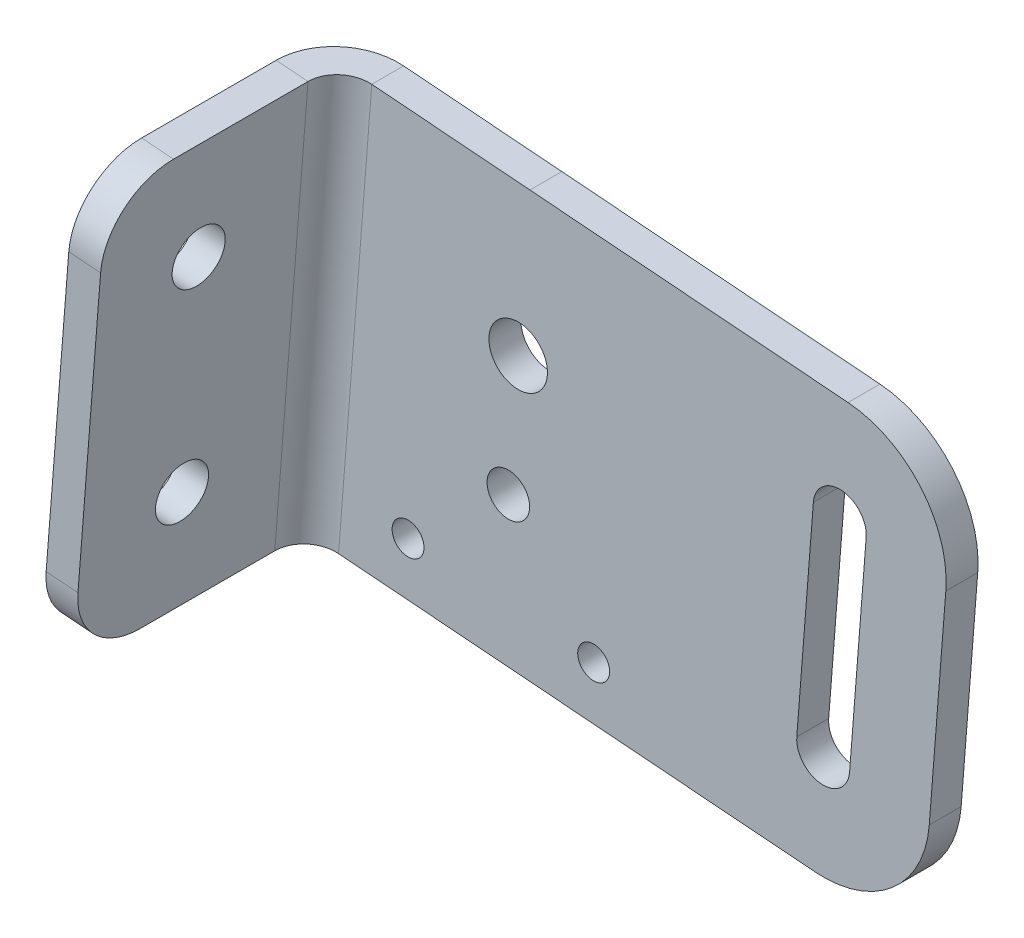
ISO-10303-21;
HEADER;
FILE_DESCRIPTION(('STEP AP214'),'2;1');
FILE_NAME('part.step','',(''),(''),'','','');
FILE_SCHEMA(('AUTOMOTIVE_DESIGN { 1 0 10303 214 1 1 1 1 }'));
ENDSEC;
DATA;
#1=APPLICATION_CONTEXT('core data for automotive mechanical design processes');
#2=APPLICATION_PROTOCOL_DEFINITION('international standard','automotive_design',2000,#1);
#3=PRODUCT_CONTEXT('',#1,'mechanical');
#4=PRODUCT('Part','Part','',(#3));
#5=PRODUCT_RELATED_PRODUCT_CATEGORY('part','',(#4));
#6=PRODUCT_DEFINITION_FORMATION('','',#4);
#7=PRODUCT_DEFINITION_CONTEXT('part definition',#1,'design');
#8=PRODUCT_DEFINITION('design','',#6,#7);
#9=PRODUCT_DEFINITION_SHAPE('','',#8);
#10=(LENGTH_UNIT() NAMED_UNIT(*) SI_UNIT(.MILLI.,.METRE.));
#11=(NAMED_UNIT(*) PLANE_ANGLE_UNIT() SI_UNIT($,.RADIAN.));
#12=(NAMED_UNIT(*) SI_UNIT($,.STERADIAN.) SOLID_ANGLE_UNIT());
#13=UNCERTAINTY_MEASURE_WITH_UNIT(LENGTH_MEASURE(1.E-05),#10,'distance_accuracy_value','');
#14=(GEOMETRIC_REPRESENTATION_CONTEXT(3) GLOBAL_UNCERTAINTY_ASSIGNED_CONTEXT((#13)) GLOBAL_UNIT_ASSIGNED_CONTEXT((#10,
#11,#12)) REPRESENTATION_CONTEXT('',''));
#15=CARTESIAN_POINT('',(0.,0.,0.));
#16=DIRECTION('',(0.,0.,1.));
#17=DIRECTION('',(1.,0.,0.));
#18=AXIS2_PLACEMENT_3D('',#15,#16,#17);
#19=CARTESIAN_POINT('',(0.,0.,0.));
#20=DIRECTION('',(0.0782505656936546,0.996933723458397,0.));
#21=DIRECTION('',(-0.996933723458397,0.0782505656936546,0.));
#22=AXIS2_PLACEMENT_3D('',#19,#20,#21);
#23=PLANE('',#22);
#24=DIRECTION('',(-0.996933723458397,0.0782505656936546,0.));
#25=VECTOR('',#24,1.);
#26=CARTESIAN_POINT('',(0.,0.,3.));
#27=LINE('',#26,#25);
#28=CARTESIAN_POINT('',(34.8928029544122,-2.73878835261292,3.));
#29=VERTEX_POINT('',#28);
#30=CARTESIAN_POINT('',(5.98160234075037,-0.469503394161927,3.));
#31=VERTEX_POINT('',#30);
#32=EDGE_CURVE('E254',#29,#31,#27,.T.);
#33=ORIENTED_EDGE('',*,*,#32,.T.);
#34=DIRECTION('',(0.,0.,-1.));
#35=VECTOR('',#34,1.);
#36=CARTESIAN_POINT('',(5.98160234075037,-0.469503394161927,2.99999999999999));
#37=LINE('',#36,#35);
#38=CARTESIAN_POINT('',(5.98160234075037,-0.469503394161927,0.));
#39=VERTEX_POINT('',#38);
#40=EDGE_CURVE('E243',#31,#39,#37,.T.);
#41=ORIENTED_EDGE('',*,*,#40,.T.);
#42=DIRECTION('',(-0.996933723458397,0.0782505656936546,0.));
#43=VECTOR('',#42,1.);
#44=CARTESIAN_POINT('',(0.,0.,0.));
#45=LINE('',#44,#43);
#46=CARTESIAN_POINT('',(34.8928029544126,-2.73878835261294,0.));
#47=VERTEX_POINT('',#46);
#48=EDGE_CURVE('E257',#47,#39,#45,.T.);
#49=ORIENTED_EDGE('',*,*,#48,.F.);
#50=CARTESIAN_POINT('',(34.8928022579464,-2.73879722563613,3.));
#51=DIRECTION('',(0.,0.,-1.));
#52=VECTOR('',#51,1.);
#53=LINE('',#50,#52);
#54=EDGE_CURVE('E303',#29,#47,#53,.T.);
#55=ORIENTED_EDGE('',*,*,#54,.F.);
#56=EDGE_LOOP('',(#33,#41,#49,#55));
#57=FACE_BOUND('',#56,.T.);
#58=ADVANCED_FACE('F65',(#57),#23,.F.);
#59=CARTESIAN_POINT('',(0.,0.,0.));
#60=DIRECTION('',(0.,0.,1.));
#61=DIRECTION('',(1.,0.,0.));
#62=AXIS2_PLACEMENT_3D('',#59,#60,#61);
#63=PLANE('',#62);
#64=CARTESIAN_POINT('',(51.5367023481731,5.9573277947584,0.));
#65=DIRECTION('',(0.,0.,1.));
#66=DIRECTION('',(1.,0.,0.));
#67=AXIS2_PLACEMENT_3D('',#64,#65,#66);
#68=CIRCLE('',#67,2.48920000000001);
#69=CARTESIAN_POINT('',(49.0551351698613,6.15211223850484,0.));
#70=VERTEX_POINT('',#69);
#71=CARTESIAN_POINT('',(54.0182695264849,5.76254335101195,0.));
#72=VERTEX_POINT('',#71);
#73=EDGE_CURVE('E291',#70,#72,#68,.T.);
#74=ORIENTED_EDGE('',*,*,#73,.T.);
#75=DIRECTION('',(-0.0782518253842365,-0.996933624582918,0.));
#76=VECTOR('',#75,1.);
#77=CARTESIAN_POINT('',(53.2379500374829,-4.17878047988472,0.));
#78=LINE('',#77,#76);
#79=CARTESIAN_POINT('',(55.5789043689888,25.6451383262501,0.));
#80=VERTEX_POINT('',#79);
#81=EDGE_CURVE('E294',#80,#72,#78,.T.);
#82=ORIENTED_EDGE('',*,*,#81,.F.);
#83=CARTESIAN_POINT('',(53.097337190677,25.8399227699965,0.));
#84=DIRECTION('',(0.,0.,1.));
#85=DIRECTION('',(1.,0.,0.));
#86=AXIS2_PLACEMENT_3D('',#83,#84,#85);
#87=CIRCLE('',#86,2.48920000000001);
#88=CARTESIAN_POINT('',(50.6157700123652,26.034707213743,0.));
#89=VERTEX_POINT('',#88);
#90=EDGE_CURVE('E297',#80,#89,#87,.T.);
#91=ORIENTED_EDGE('',*,*,#90,.T.);
#92=DIRECTION('',(-0.0782518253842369,-0.996933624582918,0.));
#93=VECTOR('',#92,1.);
#94=CARTESIAN_POINT('',(48.2748156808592,-3.78921159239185,0.));
#95=LINE('',#94,#93);
#96=EDGE_CURVE('E300',#89,#70,#95,.T.);
#97=ORIENTED_EDGE('',*,*,#96,.T.);
#98=EDGE_LOOP('',(#74,#82,#91,#97));
#99=FACE_BOUND('',#98,.T.);
#100=CARTESIAN_POINT('',(29.9627994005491,2.66356121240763,0.));
#101=DIRECTION('',(0.,0.,1.));
#102=DIRECTION('',(1.,0.,0.));
#103=AXIS2_PLACEMENT_3D('',#100,#101,#102);
#104=CIRCLE('',#103,1.49999999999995);
#105=CARTESIAN_POINT('',(31.462799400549,2.66356121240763,0.));
#106=VERTEX_POINT('',#105);
#107=EDGE_CURVE('E288',#106,#106,#104,.T.);
#108=ORIENTED_EDGE('',*,*,#107,.T.);
#109=EDGE_LOOP('',(#108));
#110=FACE_BOUND('',#109,.T.);
#111=CARTESIAN_POINT('',(12.5164592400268,4.03294611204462,0.));
#112=DIRECTION('',(0.,0.,1.));
#113=DIRECTION('',(1.,0.,0.));
#114=AXIS2_PLACEMENT_3D('',#111,#112,#113);
#115=CIRCLE('',#114,1.5);
#116=CARTESIAN_POINT('',(14.0164592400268,4.03294611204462,0.));
#117=VERTEX_POINT('',#116);
#118=EDGE_CURVE('E285',#117,#117,#115,.T.);
#119=ORIENTED_EDGE('',*,*,#118,.T.);
#120=EDGE_LOOP('',(#119));
#121=FACE_BOUND('',#120,.T.);
#122=CARTESIAN_POINT('',(21.9438844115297,12.3206571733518,0.));
#123=DIRECTION('',(0.,0.,1.));
#124=DIRECTION('',(1.,0.,0.));
#125=AXIS2_PLACEMENT_3D('',#122,#123,#124);
#126=CIRCLE('',#125,1.99999999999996);
#127=CARTESIAN_POINT('',(23.9438844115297,12.3206571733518,0.));
#128=VERTEX_POINT('',#127);
#129=EDGE_CURVE('E282',#128,#128,#126,.T.);
#130=ORIENTED_EDGE('',*,*,#129,.T.);
#131=EDGE_LOOP('',(#130));
#132=FACE_BOUND('',#131,.T.);
#133=CARTESIAN_POINT('',(22.8672852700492,24.084397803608,0.));
#134=DIRECTION('',(0.,0.,1.));
#135=DIRECTION('',(1.,0.,0.));
#136=AXIS2_PLACEMENT_3D('',#133,#134,#135);
#137=CIRCLE('',#136,2.74999999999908);
#138=CARTESIAN_POINT('',(25.6172852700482,24.084397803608,0.));
#139=VERTEX_POINT('',#138);
#140=EDGE_CURVE('E277',#139,#139,#137,.T.);
#141=ORIENTED_EDGE('',*,*,#140,.T.);
#142=EDGE_LOOP('',(#141));
#143=FACE_BOUND('',#142,.T.);
#144=DIRECTION('',(0.996933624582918,-0.078251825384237,0.));
#145=VECTOR('',#144,1.);
#146=CARTESIAN_POINT('',(3.12127175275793,39.7652162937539,0.));
#147=LINE('',#146,#145);
#148=CARTESIAN_POINT('',(23.9696547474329,38.1287743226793,0.));
#149=VERTEX_POINT('',#148);
#150=CARTESIAN_POINT('',(53.877654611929,35.7812202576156,0.));
#151=VERTEX_POINT('',#150);
#152=EDGE_CURVE('E265',#149,#151,#147,.T.);
#153=ORIENTED_EDGE('',*,*,#152,.T.);
#154=CARTESIAN_POINT('',(53.0951363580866,25.8118840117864,0.));
#155=DIRECTION('',(0.,0.,1.));
#156=DIRECTION('',(1.,0.,0.));
#157=AXIS2_PLACEMENT_3D('',#154,#155,#156);
#158=CIRCLE('',#157,10.);
#159=CARTESIAN_POINT('',(63.0644726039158,25.029365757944,0.));
#160=VERTEX_POINT('',#159);
#161=EDGE_CURVE('E473',#151,#160,#158,.F.);
#162=ORIENTED_EDGE('',*,*,#161,.T.);
#163=DIRECTION('',(-0.0782518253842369,-0.996933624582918,0.));
#164=VECTOR('',#163,1.);
#165=CARTESIAN_POINT('',(60.7257191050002,-4.76651428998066,0.));
#166=LINE('',#165,#164);
#167=CARTESIAN_POINT('',(61.5082394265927,5.20284829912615,0.));
#168=VERTEX_POINT('',#167);
#169=EDGE_CURVE('E270',#160,#168,#166,.T.);
#170=ORIENTED_EDGE('',*,*,#169,.T.);
#171=CARTESIAN_POINT('',(51.5389031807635,5.98536655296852,0.));
#172=DIRECTION('',(0.,0.,1.));
#173=DIRECTION('',(1.,0.,0.));
#174=AXIS2_PLACEMENT_3D('',#171,#172,#173);
#175=CIRCLE('',#174,10.);
#176=CARTESIAN_POINT('',(50.7563849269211,-3.98396969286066,0.));
#177=VERTEX_POINT('',#176);
#178=EDGE_CURVE('E471',#168,#177,#175,.F.);
#179=ORIENTED_EDGE('',*,*,#178,.T.);
#180=DIRECTION('',(0.996933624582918,-0.0782518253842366,0.));
#181=VECTOR('',#180,1.);
#182=CARTESIAN_POINT('',(2.06775005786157E-06,2.6343277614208E-05,0.));
#183=LINE('',#182,#181);
#184=EDGE_CURVE('E275',#47,#177,#183,.T.);
#185=ORIENTED_EDGE('',*,*,#184,.F.);
#186=ORIENTED_EDGE('',*,*,#48,.T.);
#187=DIRECTION('',(-0.0782505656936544,-0.996933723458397,0.));
#188=VECTOR('',#187,1.);
#189=CARTESIAN_POINT('',(5.98160234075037,-0.469503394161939,0.));
#190=LINE('',#189,#188);
#191=CARTESIAN_POINT('',(9.10282177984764,39.2956905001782,0.));
#192=VERTEX_POINT('',#191);
#193=EDGE_CURVE('E213',#39,#192,#190,.F.);
#194=ORIENTED_EDGE('',*,*,#193,.T.);
#195=DIRECTION('',(-0.996933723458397,0.0782505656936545,0.));
#196=VECTOR('',#195,1.);
#197=CARTESIAN_POINT('',(3.12121943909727,39.7651938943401,0.));
#198=LINE('',#197,#196);
#199=EDGE_CURVE('E259',#149,#192,#198,.T.);
#200=ORIENTED_EDGE('',*,*,#199,.F.);
#201=EDGE_LOOP('',(#153,#162,#170,#179,#185,#186,#194,#200));
#202=FACE_BOUND('',#201,.T.);
#203=ADVANCED_FACE('F423',(#99,#110,#121,#132,#143,#202),#63,.F.);
#204=CARTESIAN_POINT('',(0.,0.,3.));
#205=DIRECTION('',(0.,0.,1.));
#206=DIRECTION('',(1.,0.,0.));
#207=AXIS2_PLACEMENT_3D('',#204,#205,#206);
#208=PLANE('',#207);
#209=CARTESIAN_POINT('',(22.8672852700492,24.084397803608,3.));
#210=DIRECTION('',(0.,0.,1.));
#211=DIRECTION('',(1.,0.,0.));
#212=AXIS2_PLACEMENT_3D('',#209,#210,#211);
#213=CIRCLE('',#212,2.74999999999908);
#214=CARTESIAN_POINT('',(25.6172852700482,24.084397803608,3.));
#215=VERTEX_POINT('',#214);
#216=EDGE_CURVE('E313',#215,#215,#213,.T.);
#217=ORIENTED_EDGE('',*,*,#216,.F.);
#218=EDGE_LOOP('',(#217));
#219=FACE_BOUND('',#218,.T.);
#220=CARTESIAN_POINT('',(21.9438844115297,12.3206571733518,3.));
#221=DIRECTION('',(0.,0.,1.));
#222=DIRECTION('',(1.,0.,0.));
#223=AXIS2_PLACEMENT_3D('',#220,#221,#222);
#224=CIRCLE('',#223,1.99999999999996);
#225=CARTESIAN_POINT('',(23.9438844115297,12.3206571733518,3.));
#226=VERTEX_POINT('',#225);
#227=EDGE_CURVE('E316',#226,#226,#224,.T.);
#228=ORIENTED_EDGE('',*,*,#227,.F.);
#229=EDGE_LOOP('',(#228));
#230=FACE_BOUND('',#229,.T.);
#231=CARTESIAN_POINT('',(12.5164592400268,4.03294611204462,3.));
#232=DIRECTION('',(0.,0.,1.));
#233=DIRECTION('',(1.,0.,0.));
#234=AXIS2_PLACEMENT_3D('',#231,#232,#233);
#235=CIRCLE('',#234,1.5);
#236=CARTESIAN_POINT('',(14.0164592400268,4.03294611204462,3.));
#237=VERTEX_POINT('',#236);
#238=EDGE_CURVE('E319',#237,#237,#235,.T.);
#239=ORIENTED_EDGE('',*,*,#238,.F.);
#240=EDGE_LOOP('',(#239));
#241=FACE_BOUND('',#240,.T.);
#242=CARTESIAN_POINT('',(29.9627994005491,2.66356121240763,3.));
#243=DIRECTION('',(0.,0.,1.));
#244=DIRECTION('',(1.,0.,0.));
#245=AXIS2_PLACEMENT_3D('',#242,#243,#244);
#246=CIRCLE('',#245,1.49999999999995);
#247=CARTESIAN_POINT('',(31.462799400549,2.66356121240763,3.));
#248=VERTEX_POINT('',#247);
#249=EDGE_CURVE('E322',#248,#248,#246,.T.);
#250=ORIENTED_EDGE('',*,*,#249,.F.);
#251=EDGE_LOOP('',(#250));
#252=FACE_BOUND('',#251,.T.);
#253=CARTESIAN_POINT('',(51.5367023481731,5.9573277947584,3.));
#254=DIRECTION('',(0.,0.,1.));
#255=DIRECTION('',(1.,0.,0.));
#256=AXIS2_PLACEMENT_3D('',#253,#254,#255);
#257=CIRCLE('',#256,2.48920000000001);
#258=CARTESIAN_POINT('',(49.0551351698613,6.15211223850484,3.));
#259=VERTEX_POINT('',#258);
#260=CARTESIAN_POINT('',(54.0182695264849,5.76254335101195,3.));
#261=VERTEX_POINT('',#260);
#262=EDGE_CURVE('E325',#259,#261,#257,.T.);
#263=ORIENTED_EDGE('',*,*,#262,.F.);
#264=DIRECTION('',(-0.0782518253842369,-0.996933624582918,0.));
#265=VECTOR('',#264,1.);
#266=CARTESIAN_POINT('',(48.2748156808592,-3.78921159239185,3.));
#267=LINE('',#266,#265);
#268=CARTESIAN_POINT('',(50.6157700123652,26.034707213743,3.));
#269=VERTEX_POINT('',#268);
#270=EDGE_CURVE('E260',#269,#259,#267,.T.);
#271=ORIENTED_EDGE('',*,*,#270,.F.);
#272=CARTESIAN_POINT('',(53.097337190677,25.8399227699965,3.));
#273=DIRECTION('',(0.,0.,1.));
#274=DIRECTION('',(1.,0.,0.));
#275=AXIS2_PLACEMENT_3D('',#272,#273,#274);
#276=CIRCLE('',#275,2.48920000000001);
#277=CARTESIAN_POINT('',(55.5789043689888,25.6451383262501,3.));
#278=VERTEX_POINT('',#277);
#279=EDGE_CURVE('E331',#278,#269,#276,.T.);
#280=ORIENTED_EDGE('',*,*,#279,.F.);
#281=DIRECTION('',(-0.0782518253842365,-0.996933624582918,0.));
#282=VECTOR('',#281,1.);
#283=CARTESIAN_POINT('',(53.2379500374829,-4.17878047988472,3.));
#284=LINE('',#283,#282);
#285=EDGE_CURVE('E328',#278,#261,#284,.T.);
#286=ORIENTED_EDGE('',*,*,#285,.T.);
#287=EDGE_LOOP('',(#263,#271,#280,#286));
#288=FACE_BOUND('',#287,.T.);
#289=DIRECTION('',(-0.0782518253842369,-0.996933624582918,0.));
#290=VECTOR('',#289,1.);
#291=CARTESIAN_POINT('',(60.7257191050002,-4.76651428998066,3.));
#292=LINE('',#291,#290);
#293=CARTESIAN_POINT('',(63.0644726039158,25.029365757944,3.));
#294=VERTEX_POINT('',#293);
#295=CARTESIAN_POINT('',(61.5082394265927,5.20284829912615,3.));
#296=VERTEX_POINT('',#295);
#297=EDGE_CURVE('E304',#294,#296,#292,.T.);
#298=ORIENTED_EDGE('',*,*,#297,.F.);
#299=CARTESIAN_POINT('',(53.0951363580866,25.8118840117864,3.));
#300=DIRECTION('',(0.,0.,1.));
#301=DIRECTION('',(1.,0.,0.));
#302=AXIS2_PLACEMENT_3D('',#299,#300,#301);
#303=CIRCLE('',#302,10.);
#304=CARTESIAN_POINT('',(53.877654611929,35.7812202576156,3.));
#305=VERTEX_POINT('',#304);
#306=EDGE_CURVE('E73',#294,#305,#303,.T.);
#307=ORIENTED_EDGE('',*,*,#306,.T.);
#308=DIRECTION('',(0.996933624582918,-0.078251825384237,0.));
#309=VECTOR('',#308,1.);
#310=CARTESIAN_POINT('',(3.12127175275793,39.7652162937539,3.));
#311=LINE('',#310,#309);
#312=CARTESIAN_POINT('',(23.9696547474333,38.1287743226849,3.));
#313=VERTEX_POINT('',#312);
#314=EDGE_CURVE('E307',#313,#305,#311,.T.);
#315=ORIENTED_EDGE('',*,*,#314,.F.);
#316=DIRECTION('',(-0.996933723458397,0.0782505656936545,0.));
#317=VECTOR('',#316,1.);
#318=CARTESIAN_POINT('',(3.12121943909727,39.7651938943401,3.));
#319=LINE('',#318,#317);
#320=CARTESIAN_POINT('',(9.10282177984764,39.2956905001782,2.99999999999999));
#321=VERTEX_POINT('',#320);
#322=EDGE_CURVE('E310',#313,#321,#319,.T.);
#323=ORIENTED_EDGE('',*,*,#322,.T.);
#324=DIRECTION('',(-0.0782505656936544,-0.996933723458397,0.));
#325=VECTOR('',#324,1.);
#326=CARTESIAN_POINT('',(5.98160234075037,-0.469503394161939,2.99999999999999));
#327=LINE('',#326,#325);
#328=EDGE_CURVE('E247',#31,#321,#327,.F.);
#329=ORIENTED_EDGE('',*,*,#328,.F.);
#330=ORIENTED_EDGE('',*,*,#32,.F.);
#331=DIRECTION('',(0.996933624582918,-0.0782518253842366,0.));
#332=VECTOR('',#331,1.);
#333=CARTESIAN_POINT('',(2.06775005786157E-06,2.6343277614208E-05,3.));
#334=LINE('',#333,#332);
#335=CARTESIAN_POINT('',(50.7563849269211,-3.98396969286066,3.));
#336=VERTEX_POINT('',#335);
#337=EDGE_CURVE('E306',#29,#336,#334,.T.);
#338=ORIENTED_EDGE('',*,*,#337,.T.);
#339=CARTESIAN_POINT('',(51.5389031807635,5.98536655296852,3.));
#340=DIRECTION('',(0.,0.,1.));
#341=DIRECTION('',(1.,0.,0.));
#342=AXIS2_PLACEMENT_3D('',#339,#340,#341);
#343=CIRCLE('',#342,10.);
#344=EDGE_CURVE('E85',#336,#296,#343,.T.);
#345=ORIENTED_EDGE('',*,*,#344,.T.);
#346=EDGE_LOOP('',(#298,#307,#315,#323,#329,#330,#338,#345));
#347=FACE_BOUND('',#346,.T.);
#348=ADVANCED_FACE('F395',(#219,#230,#241,#252,#288,#347),#208,.T.);
#349=CARTESIAN_POINT('',(53.097337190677,25.8399227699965,0.));
#350=DIRECTION('',(0.,0.,1.));
#351=DIRECTION('',(1.,0.,0.));
#352=AXIS2_PLACEMENT_3D('',#349,#350,#351);
#353=CYLINDRICAL_SURFACE('',#352,2.48920000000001);
#354=DIRECTION('',(0.,0.,-1.));
#355=VECTOR('',#354,1.);
#356=CARTESIAN_POINT('',(55.5789043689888,25.6451383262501,0.));
#357=LINE('',#356,#355);
#358=EDGE_CURVE('E448',#278,#80,#357,.T.);
#359=ORIENTED_EDGE('',*,*,#358,.F.);
#360=ORIENTED_EDGE('',*,*,#279,.T.);
#361=DIRECTION('',(0.,0.,-1.));
#362=VECTOR('',#361,1.);
#363=CARTESIAN_POINT('',(50.6157700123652,26.034707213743,0.));
#364=LINE('',#363,#362);
#365=EDGE_CURVE('E452',#269,#89,#364,.T.);
#366=ORIENTED_EDGE('',*,*,#365,.T.);
#367=ORIENTED_EDGE('',*,*,#90,.F.);
#368=EDGE_LOOP('',(#359,#360,#366,#367));
#369=FACE_BOUND('',#368,.T.);
#370=ADVANCED_FACE('F391',(#369),#353,.F.);
#371=CARTESIAN_POINT('',(48.2748156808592,-3.78921159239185,0.));
#372=DIRECTION('',(-0.996933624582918,0.0782518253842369,0.));
#373=DIRECTION('',(-0.0782518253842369,-0.996933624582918,0.));
#374=AXIS2_PLACEMENT_3D('',#371,#372,#373);
#375=PLANE('',#374);
#376=ORIENTED_EDGE('',*,*,#365,.F.);
#377=ORIENTED_EDGE('',*,*,#270,.T.);
#378=DIRECTION('',(0.,0.,-1.));
#379=VECTOR('',#378,1.);
#380=CARTESIAN_POINT('',(49.0551351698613,6.15211223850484,0.));
#381=LINE('',#380,#379);
#382=EDGE_CURVE('E517',#259,#70,#381,.T.);
#383=ORIENTED_EDGE('',*,*,#382,.T.);
#384=ORIENTED_EDGE('',*,*,#96,.F.);
#385=EDGE_LOOP('',(#376,#377,#383,#384));
#386=FACE_BOUND('',#385,.T.);
#387=ADVANCED_FACE('F387',(#386),#375,.F.);
#388=CARTESIAN_POINT('',(51.5367023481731,5.9573277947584,0.));
#389=DIRECTION('',(0.,0.,1.));
#390=DIRECTION('',(1.,0.,0.));
#391=AXIS2_PLACEMENT_3D('',#388,#389,#390);
#392=CYLINDRICAL_SURFACE('',#391,2.48920000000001);
#393=ORIENTED_EDGE('',*,*,#382,.F.);
#394=ORIENTED_EDGE('',*,*,#262,.T.);
#395=DIRECTION('',(0.,0.,-1.));
#396=VECTOR('',#395,1.);
#397=CARTESIAN_POINT('',(54.0182695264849,5.76254335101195,0.));
#398=LINE('',#397,#396);
#399=EDGE_CURVE('E455',#261,#72,#398,.T.);
#400=ORIENTED_EDGE('',*,*,#399,.T.);
#401=ORIENTED_EDGE('',*,*,#73,.F.);
#402=EDGE_LOOP('',(#393,#394,#400,#401));
#403=FACE_BOUND('',#402,.T.);
#404=ADVANCED_FACE('F367',(#403),#392,.F.);
#405=CARTESIAN_POINT('',(3.12121943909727,39.7651938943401,0.));
#406=DIRECTION('',(0.0782505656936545,0.996933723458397,0.));
#407=DIRECTION('',(-0.996933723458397,0.0782505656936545,0.));
#408=AXIS2_PLACEMENT_3D('',#405,#406,#407);
#409=PLANE('',#408);
#410=DIRECTION('',(0.,0.,-1.));
#411=VECTOR('',#410,1.);
#412=CARTESIAN_POINT('',(9.10282177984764,39.2956905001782,2.99999999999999));
#413=LINE('',#412,#411);
#414=EDGE_CURVE('E251',#321,#192,#413,.T.);
#415=ORIENTED_EDGE('',*,*,#414,.F.);
#416=ORIENTED_EDGE('',*,*,#322,.F.);
#417=DIRECTION('',(0.,0.,-1.));
#418=VECTOR('',#417,1.);
#419=CARTESIAN_POINT('',(23.9696547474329,38.1287743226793,0.));
#420=LINE('',#419,#418);
#421=EDGE_CURVE('E485',#313,#149,#420,.T.);
#422=ORIENTED_EDGE('',*,*,#421,.T.);
#423=ORIENTED_EDGE('',*,*,#199,.T.);
#424=EDGE_LOOP('',(#415,#416,#422,#423));
#425=FACE_BOUND('',#424,.T.);
#426=ADVANCED_FACE('F363',(#425),#409,.T.);
#427=CARTESIAN_POINT('',(3.12127175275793,39.7652162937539,0.));
#428=DIRECTION('',(-0.078251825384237,-0.996933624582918,0.));
#429=DIRECTION('',(0.996933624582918,-0.078251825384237,0.));
#430=AXIS2_PLACEMENT_3D('',#427,#428,#429);
#431=PLANE('',#430);
#432=ORIENTED_EDGE('',*,*,#314,.T.);
#433=DIRECTION('',(0.,0.,1.));
#434=VECTOR('',#433,1.);
#435=CARTESIAN_POINT('',(53.877654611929,35.7812202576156,0.));
#436=LINE('',#435,#434);
#437=EDGE_CURVE('E468',#305,#151,#436,.F.);
#438=ORIENTED_EDGE('',*,*,#437,.T.);
#439=ORIENTED_EDGE('',*,*,#152,.F.);
#440=ORIENTED_EDGE('',*,*,#421,.F.);
#441=EDGE_LOOP('',(#432,#438,#439,#440));
#442=FACE_BOUND('',#441,.T.);
#443=ADVANCED_FACE('F359',(#442),#431,.F.);
#444=CARTESIAN_POINT('',(60.7257191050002,-4.76651428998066,0.));
#445=DIRECTION('',(-0.996933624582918,0.0782518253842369,0.));
#446=DIRECTION('',(-0.0782518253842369,-0.996933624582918,0.));
#447=AXIS2_PLACEMENT_3D('',#444,#445,#446);
#448=PLANE('',#447);
#449=ORIENTED_EDGE('',*,*,#169,.F.);
#450=DIRECTION('',(0.,0.,1.));
#451=VECTOR('',#450,1.);
#452=CARTESIAN_POINT('',(63.0644726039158,25.029365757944,0.));
#453=LINE('',#452,#451);
#454=EDGE_CURVE('E478',#160,#294,#453,.T.);
#455=ORIENTED_EDGE('',*,*,#454,.T.);
#456=ORIENTED_EDGE('',*,*,#297,.T.);
#457=DIRECTION('',(0.,0.,-1.));
#458=VECTOR('',#457,1.);
#459=CARTESIAN_POINT('',(61.5082394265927,5.20284829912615,0.));
#460=LINE('',#459,#458);
#461=EDGE_CURVE('E475',#296,#168,#460,.T.);
#462=ORIENTED_EDGE('',*,*,#461,.T.);
#463=EDGE_LOOP('',(#449,#455,#456,#462));
#464=FACE_BOUND('',#463,.T.);
#465=ADVANCED_FACE('F354',(#464),#448,.F.);
#466=CARTESIAN_POINT('',(2.06775005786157E-06,2.6343277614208E-05,0.));
#467=DIRECTION('',(-0.0782518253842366,-0.996933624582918,0.));
#468=DIRECTION('',(0.996933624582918,-0.0782518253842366,0.));
#469=AXIS2_PLACEMENT_3D('',#466,#467,#468);
#470=PLANE('',#469);
#471=ORIENTED_EDGE('',*,*,#184,.T.);
#472=DIRECTION('',(0.,0.,1.));
#473=VECTOR('',#472,1.);
#474=CARTESIAN_POINT('',(50.7563849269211,-3.98396969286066,0.));
#475=LINE('',#474,#473);
#476=EDGE_CURVE('E13',#177,#336,#475,.T.);
#477=ORIENTED_EDGE('',*,*,#476,.T.);
#478=ORIENTED_EDGE('',*,*,#337,.F.);
#479=ORIENTED_EDGE('',*,*,#54,.T.);
#480=EDGE_LOOP('',(#471,#477,#478,#479));
#481=FACE_BOUND('',#480,.T.);
#482=ADVANCED_FACE('F343',(#481),#470,.T.);
#483=CARTESIAN_POINT('',(22.8672852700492,24.084397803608,0.));
#484=DIRECTION('',(0.,0.,1.));
#485=DIRECTION('',(1.,0.,0.));
#486=AXIS2_PLACEMENT_3D('',#483,#484,#485);
#487=CYLINDRICAL_SURFACE('',#486,2.74999999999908);
#488=ORIENTED_EDGE('',*,*,#140,.F.);
#489=EDGE_LOOP('',(#488));
#490=FACE_BOUND('',#489,.T.);
#491=ORIENTED_EDGE('',*,*,#216,.T.);
#492=EDGE_LOOP('',(#491));
#493=FACE_BOUND('',#492,.T.);
#494=ADVANCED_FACE('F353',(#490,#493),#487,.F.);
#495=CARTESIAN_POINT('',(21.9438844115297,12.3206571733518,0.));
#496=DIRECTION('',(0.,0.,1.));
#497=DIRECTION('',(1.,0.,0.));
#498=AXIS2_PLACEMENT_3D('',#495,#496,#497);
#499=CYLINDRICAL_SURFACE('',#498,1.99999999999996);
#500=ORIENTED_EDGE('',*,*,#129,.F.);
#501=EDGE_LOOP('',(#500));
#502=FACE_BOUND('',#501,.T.);
#503=ORIENTED_EDGE('',*,*,#227,.T.);
#504=EDGE_LOOP('',(#503));
#505=FACE_BOUND('',#504,.T.);
#506=ADVANCED_FACE('F371',(#502,#505),#499,.F.);
#507=CARTESIAN_POINT('',(12.5164592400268,4.03294611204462,0.));
#508=DIRECTION('',(0.,0.,1.));
#509=DIRECTION('',(1.,0.,0.));
#510=AXIS2_PLACEMENT_3D('',#507,#508,#509);
#511=CYLINDRICAL_SURFACE('',#510,1.5);
#512=ORIENTED_EDGE('',*,*,#118,.F.);
#513=EDGE_LOOP('',(#512));
#514=FACE_BOUND('',#513,.T.);
#515=ORIENTED_EDGE('',*,*,#238,.T.);
#516=EDGE_LOOP('',(#515));
#517=FACE_BOUND('',#516,.T.);
#518=ADVANCED_FACE('F375',(#514,#517),#511,.F.);
#519=CARTESIAN_POINT('',(29.9627994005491,2.66356121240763,0.));
#520=DIRECTION('',(0.,0.,1.));
#521=DIRECTION('',(1.,0.,0.));
#522=AXIS2_PLACEMENT_3D('',#519,#520,#521);
#523=CYLINDRICAL_SURFACE('',#522,1.49999999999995);
#524=ORIENTED_EDGE('',*,*,#107,.F.);
#525=EDGE_LOOP('',(#524));
#526=FACE_BOUND('',#525,.T.);
#527=ORIENTED_EDGE('',*,*,#249,.T.);
#528=EDGE_LOOP('',(#527));
#529=FACE_BOUND('',#528,.T.);
#530=ADVANCED_FACE('F379',(#526,#529),#523,.F.);
#531=CARTESIAN_POINT('',(53.2379500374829,-4.17878047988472,0.));
#532=DIRECTION('',(-0.996933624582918,0.0782518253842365,0.));
#533=DIRECTION('',(-0.0782518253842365,-0.996933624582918,0.));
#534=AXIS2_PLACEMENT_3D('',#531,#532,#533);
#535=PLANE('',#534);
#536=ORIENTED_EDGE('',*,*,#285,.F.);
#537=ORIENTED_EDGE('',*,*,#358,.T.);
#538=ORIENTED_EDGE('',*,*,#81,.T.);
#539=ORIENTED_EDGE('',*,*,#399,.F.);
#540=EDGE_LOOP('',(#536,#537,#538,#539));
#541=FACE_BOUND('',#540,.T.);
#542=ADVANCED_FACE('F383',(#541),#535,.T.);
#543=CARTESIAN_POINT('',(9.10282177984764,39.2956905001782,6.));
#544=DIRECTION('',(0.0782505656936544,0.996933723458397,0.));
#545=DIRECTION('',(-0.996933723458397,0.0782505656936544,0.));
#546=AXIS2_PLACEMENT_3D('',#543,#544,#545);
#547=PLANE('',#546);
#548=DIRECTION('',(-0.996933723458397,0.0782505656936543,0.));
#549=VECTOR('',#548,1.);
#550=CARTESIAN_POINT('',(3.12121943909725,39.7651938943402,5.99999999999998));
#551=LINE('',#550,#549);
#552=CARTESIAN_POINT('',(6.11202060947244,39.5304421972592,5.99999999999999));
#553=VERTEX_POINT('',#552);
#554=CARTESIAN_POINT('',(3.12121943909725,39.7651938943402,5.99999999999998));
#555=VERTEX_POINT('',#554);
#556=EDGE_CURVE('E237',#553,#555,#551,.T.);
#557=ORIENTED_EDGE('',*,*,#556,.F.);
#558=CARTESIAN_POINT('',(9.10282177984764,39.2956905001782,6.));
#559=DIRECTION('',(-0.0782505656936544,-0.996933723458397,0.));
#560=DIRECTION('',(0.996933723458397,-0.0782505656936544,0.));
#561=AXIS2_PLACEMENT_3D('',#558,#559,#560);
#562=CIRCLE('',#561,3.);
#563=EDGE_CURVE('E216',#321,#553,#562,.F.);
#564=ORIENTED_EDGE('',*,*,#563,.F.);
#565=ORIENTED_EDGE('',*,*,#414,.T.);
#566=CARTESIAN_POINT('',(9.10282177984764,39.2956905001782,6.));
#567=DIRECTION('',(-0.0782505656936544,-0.996933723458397,0.));
#568=DIRECTION('',(0.996933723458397,-0.0782505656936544,0.));
#569=AXIS2_PLACEMENT_3D('',#566,#567,#568);
#570=CIRCLE('',#569,6.);
#571=EDGE_CURVE('E242',#192,#555,#570,.F.);
#572=ORIENTED_EDGE('',*,*,#571,.T.);
#573=EDGE_LOOP('',(#557,#564,#565,#572));
#574=FACE_BOUND('',#573,.T.);
#575=ADVANCED_FACE('F399',(#574),#547,.T.);
#576=CARTESIAN_POINT('',(5.98160234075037,-0.469503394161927,6.));
#577=DIRECTION('',(0.0782505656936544,0.996933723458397,0.));
#578=DIRECTION('',(-0.996933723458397,0.0782505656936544,0.));
#579=AXIS2_PLACEMENT_3D('',#576,#577,#578);
#580=PLANE('',#579);
#581=CARTESIAN_POINT('',(5.98160234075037,-0.469503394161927,6.));
#582=DIRECTION('',(-0.0782505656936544,-0.996933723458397,0.));
#583=DIRECTION('',(0.996933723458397,-0.0782505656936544,0.));
#584=AXIS2_PLACEMENT_3D('',#581,#582,#583);
#585=CIRCLE('',#584,3.);
#586=CARTESIAN_POINT('',(2.99080117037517,-0.234751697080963,5.99999999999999));
#587=VERTEX_POINT('',#586);
#588=EDGE_CURVE('E202',#587,#31,#585,.T.);
#589=ORIENTED_EDGE('',*,*,#588,.F.);
#590=DIRECTION('',(-0.996933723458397,0.0782505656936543,0.));
#591=VECTOR('',#590,1.);
#592=CARTESIAN_POINT('',(2.99080117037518,-0.234751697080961,5.99999999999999));
#593=LINE('',#592,#591);
#594=CARTESIAN_POINT('',(0.,0.,5.99999999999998));
#595=VERTEX_POINT('',#594);
#596=EDGE_CURVE('E196',#587,#595,#593,.T.);
#597=ORIENTED_EDGE('',*,*,#596,.T.);
#598=CARTESIAN_POINT('',(5.98160234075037,-0.469503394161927,6.));
#599=DIRECTION('',(-0.0782505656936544,-0.996933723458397,0.));
#600=DIRECTION('',(0.996933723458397,-0.0782505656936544,0.));
#601=AXIS2_PLACEMENT_3D('',#598,#599,#600);
#602=CIRCLE('',#601,6.);
#603=EDGE_CURVE('E208',#595,#39,#602,.T.);
#604=ORIENTED_EDGE('',*,*,#603,.T.);
#605=ORIENTED_EDGE('',*,*,#40,.F.);
#606=EDGE_LOOP('',(#589,#597,#604,#605));
#607=FACE_BOUND('',#606,.T.);
#608=ADVANCED_FACE('F219',(#607),#580,.F.);
#609=CARTESIAN_POINT('',(5.98160234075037,-0.469503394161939,6.));
#610=DIRECTION('',(-0.0782505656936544,-0.996933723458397,0.));
#611=DIRECTION('',(-0.996933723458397,0.0782505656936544,0.));
#612=AXIS2_PLACEMENT_3D('',#609,#610,#611);
#613=CYLINDRICAL_SURFACE('',#612,6.);
#614=ORIENTED_EDGE('',*,*,#193,.F.);
#615=ORIENTED_EDGE('',*,*,#603,.F.);
#616=DIRECTION('',(-0.0782505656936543,-0.996933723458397,0.));
#617=VECTOR('',#616,1.);
#618=CARTESIAN_POINT('',(0.,0.,5.99999999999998));
#619=LINE('',#618,#617);
#620=EDGE_CURVE('E211',#555,#595,#619,.T.);
#621=ORIENTED_EDGE('',*,*,#620,.F.);
#622=ORIENTED_EDGE('',*,*,#571,.F.);
#623=EDGE_LOOP('',(#614,#615,#621,#622));
#624=FACE_BOUND('',#623,.T.);
#625=ADVANCED_FACE('F209',(#624),#613,.T.);
#626=CARTESIAN_POINT('',(5.98160234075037,-0.469503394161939,6.));
#627=DIRECTION('',(-0.0782505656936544,-0.996933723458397,0.));
#628=DIRECTION('',(-0.996933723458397,0.0782505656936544,0.));
#629=AXIS2_PLACEMENT_3D('',#626,#627,#628);
#630=CYLINDRICAL_SURFACE('',#629,3.);
#631=ORIENTED_EDGE('',*,*,#328,.T.);
#632=ORIENTED_EDGE('',*,*,#563,.T.);
#633=DIRECTION('',(0.0782505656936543,0.996933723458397,0.));
#634=VECTOR('',#633,1.);
#635=CARTESIAN_POINT('',(6.11202060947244,39.5304421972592,5.99999999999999));
#636=LINE('',#635,#634);
#637=EDGE_CURVE('E221',#553,#587,#636,.F.);
#638=ORIENTED_EDGE('',*,*,#637,.T.);
#639=ORIENTED_EDGE('',*,*,#588,.T.);
#640=EDGE_LOOP('',(#631,#632,#638,#639));
#641=FACE_BOUND('',#640,.T.);
#642=ADVANCED_FACE('F434',(#641),#630,.F.);
#643=CARTESIAN_POINT('',(0.,0.,2.99999999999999));
#644=DIRECTION('',(-0.0782505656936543,-0.996933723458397,0.));
#645=DIRECTION('',(0.996933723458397,-0.0782505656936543,0.));
#646=AXIS2_PLACEMENT_3D('',#643,#644,#645);
#647=PLANE('',#646);
#648=DIRECTION('',(0.,0.,1.));
#649=VECTOR('',#648,1.);
#650=CARTESIAN_POINT('',(2.9908011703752,-0.234751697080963,0.));
#651=LINE('',#650,#649);
#652=CARTESIAN_POINT('',(2.99080117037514,-0.234751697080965,18.65));
#653=VERTEX_POINT('',#652);
#654=EDGE_CURVE('E440',#653,#587,#651,.F.);
#655=ORIENTED_EDGE('',*,*,#654,.F.);
#656=DIRECTION('',(0.996933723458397,-0.0782505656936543,0.));
#657=VECTOR('',#656,1.);
#658=CARTESIAN_POINT('',(0.,0.,18.65));
#659=LINE('',#658,#657);
#660=CARTESIAN_POINT('',(0.,0.,18.65));
#661=VERTEX_POINT('',#660);
#662=EDGE_CURVE('E198',#653,#661,#659,.F.);
#663=ORIENTED_EDGE('',*,*,#662,.T.);
#664=DIRECTION('',(0.,0.,-1.));
#665=VECTOR('',#664,1.);
#666=CARTESIAN_POINT('',(0.,0.,2.99999999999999));
#667=LINE('',#666,#665);
#668=EDGE_CURVE('E191',#661,#595,#667,.T.);
#669=ORIENTED_EDGE('',*,*,#668,.T.);
#670=ORIENTED_EDGE('',*,*,#596,.F.);
#671=EDGE_LOOP('',(#655,#663,#669,#670));
#672=FACE_BOUND('',#671,.T.);
#673=ADVANCED_FACE('F194',(#672),#647,.T.);
#674=CARTESIAN_POINT('',(3.12121943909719,39.7651938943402,25.));
#675=DIRECTION('',(0.0782505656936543,0.996933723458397,0.));
#676=DIRECTION('',(-0.996933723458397,0.0782505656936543,0.));
#677=AXIS2_PLACEMENT_3D('',#674,#675,#676);
#678=PLANE('',#677);
#679=DIRECTION('',(0.,0.,1.));
#680=VECTOR('',#679,1.);
#681=CARTESIAN_POINT('',(3.12121943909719,39.7651938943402,25.));
#682=LINE('',#681,#680);
#683=CARTESIAN_POINT('',(3.12121943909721,39.7651938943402,18.65));
#684=VERTEX_POINT('',#683);
#685=EDGE_CURVE('E227',#555,#684,#682,.T.);
#686=ORIENTED_EDGE('',*,*,#685,.T.);
#687=DIRECTION('',(0.996933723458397,-0.0782505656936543,0.));
#688=VECTOR('',#687,1.);
#689=CARTESIAN_POINT('',(3.12121943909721,39.7651938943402,18.65));
#690=LINE('',#689,#688);
#691=CARTESIAN_POINT('',(6.1120206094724,39.5304421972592,18.65));
#692=VERTEX_POINT('',#691);
#693=EDGE_CURVE('E445',#684,#692,#690,.T.);
#694=ORIENTED_EDGE('',*,*,#693,.T.);
#695=DIRECTION('',(0.,0.,-1.));
#696=VECTOR('',#695,1.);
#697=CARTESIAN_POINT('',(6.11202060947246,39.5304421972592,0.));
#698=LINE('',#697,#696);
#699=EDGE_CURVE('E228',#553,#692,#698,.F.);
#700=ORIENTED_EDGE('',*,*,#699,.F.);
#701=ORIENTED_EDGE('',*,*,#556,.T.);
#702=EDGE_LOOP('',(#686,#694,#700,#701));
#703=FACE_BOUND('',#702,.T.);
#704=ADVANCED_FACE('F443',(#703),#678,.T.);
#705=CARTESIAN_POINT('',(0.,0.,0.));
#706=DIRECTION('',(-0.996933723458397,0.0782505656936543,0.));
#707=DIRECTION('',(-0.0782505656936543,-0.996933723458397,0.));
#708=AXIS2_PLACEMENT_3D('',#705,#706,#707);
#709=PLANE('',#708);
#710=CARTESIAN_POINT('',(2.3431153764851,29.8519341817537,15.5));
#711=DIRECTION('',(-0.996933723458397,0.0782505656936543,0.));
#712=DIRECTION('',(-0.0782505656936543,-0.996933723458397,0.));
#713=AXIS2_PLACEMENT_3D('',#710,#711,#712);
#714=CIRCLE('',#713,2.48920000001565);
#715=CARTESIAN_POINT('',(2.14833406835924,27.3703667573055,15.5));
#716=VERTEX_POINT('',#715);
#717=EDGE_CURVE('E240',#716,#716,#714,.T.);
#718=ORIENTED_EDGE('',*,*,#717,.F.);
#719=EDGE_LOOP('',(#718));
#720=FACE_BOUND('',#719,.T.);
#721=CARTESIAN_POINT('',(0.778104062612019,9.91325971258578,15.5));
#722=DIRECTION('',(-0.996933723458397,0.0782505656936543,0.));
#723=DIRECTION('',(-0.0782505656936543,-0.996933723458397,0.));
#724=AXIS2_PLACEMENT_3D('',#721,#722,#723);
#725=CIRCLE('',#724,2.48920000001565);
#726=CARTESIAN_POINT('',(0.58332275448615,7.43169228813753,15.5));
#727=VERTEX_POINT('',#726);
#728=EDGE_CURVE('E765',#727,#727,#725,.T.);
#729=ORIENTED_EDGE('',*,*,#728,.F.);
#730=EDGE_LOOP('',(#729));
#731=FACE_BOUND('',#730,.T.);
#732=DIRECTION('',(-0.0782505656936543,-0.996933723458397,0.));
#733=VECTOR('',#732,1.);
#734=CARTESIAN_POINT('',(0.,0.,25.));
#735=LINE('',#734,#733);
#736=CARTESIAN_POINT('',(2.62432834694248,33.4346647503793,25.));
#737=VERTEX_POINT('',#736);
#738=CARTESIAN_POINT('',(0.496891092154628,6.33052914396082,25.));
#739=VERTEX_POINT('',#738);
#740=EDGE_CURVE('E203',#737,#739,#735,.T.);
#741=ORIENTED_EDGE('',*,*,#740,.F.);
#742=CARTESIAN_POINT('',(2.62432834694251,33.4346647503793,18.65));
#743=DIRECTION('',(-0.996933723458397,0.0782505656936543,0.));
#744=DIRECTION('',(-0.0782505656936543,-0.996933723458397,0.));
#745=AXIS2_PLACEMENT_3D('',#742,#743,#744);
#746=CIRCLE('',#745,6.35);
#747=EDGE_CURVE('E465',#737,#684,#746,.T.);
#748=ORIENTED_EDGE('',*,*,#747,.T.);
#749=ORIENTED_EDGE('',*,*,#685,.F.);
#750=ORIENTED_EDGE('',*,*,#620,.T.);
#751=ORIENTED_EDGE('',*,*,#668,.F.);
#752=CARTESIAN_POINT('',(0.49689109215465,6.33052914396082,18.65));
#753=DIRECTION('',(-0.996933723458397,0.0782505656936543,0.));
#754=DIRECTION('',(-0.0782505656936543,-0.996933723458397,0.));
#755=AXIS2_PLACEMENT_3D('',#752,#753,#754);
#756=CIRCLE('',#755,6.35);
#757=EDGE_CURVE('E463',#661,#739,#756,.T.);
#758=ORIENTED_EDGE('',*,*,#757,.T.);
#759=EDGE_LOOP('',(#741,#748,#749,#750,#751,#758));
#760=FACE_BOUND('',#759,.T.);
#761=ADVANCED_FACE('F225',(#720,#731,#760),#709,.T.);
#762=CARTESIAN_POINT('',(2.9908011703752,-0.234751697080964,0.));
#763=DIRECTION('',(-0.996933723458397,0.0782505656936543,0.));
#764=DIRECTION('',(-0.0782505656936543,-0.996933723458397,0.));
#765=AXIS2_PLACEMENT_3D('',#762,#763,#764);
#766=PLANE('',#765);
#767=CARTESIAN_POINT('',(5.33391654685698,29.6171824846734,15.5));
#768=DIRECTION('',(0.996933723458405,-0.0782505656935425,0.));
#769=DIRECTION('',(0.0782505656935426,0.996933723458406,0.));
#770=AXIS2_PLACEMENT_3D('',#767,#768,#769);
#771=CIRCLE('',#770,2.48920000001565);
#772=CARTESIAN_POINT('',(5.52869785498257,32.0987499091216,15.5));
#773=VERTEX_POINT('',#772);
#774=EDGE_CURVE('E770',#773,#773,#771,.T.);
#775=ORIENTED_EDGE('',*,*,#774,.F.);
#776=EDGE_LOOP('',(#775));
#777=FACE_BOUND('',#776,.T.);
#778=CARTESIAN_POINT('',(3.76890523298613,9.67850801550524,15.5));
#779=DIRECTION('',(0.996933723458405,-0.0782505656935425,0.));
#780=DIRECTION('',(0.0782505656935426,0.996933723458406,0.));
#781=AXIS2_PLACEMENT_3D('',#778,#779,#780);
#782=CIRCLE('',#781,2.48920000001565);
#783=CARTESIAN_POINT('',(3.96368654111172,12.1600754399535,15.5));
#784=VERTEX_POINT('',#783);
#785=EDGE_CURVE('E768',#784,#784,#782,.T.);
#786=ORIENTED_EDGE('',*,*,#785,.F.);
#787=EDGE_LOOP('',(#786));
#788=FACE_BOUND('',#787,.T.);
#789=ORIENTED_EDGE('',*,*,#699,.T.);
#790=CARTESIAN_POINT('',(5.6151295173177,33.1999130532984,18.65));
#791=DIRECTION('',(-0.996933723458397,0.0782505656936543,0.));
#792=DIRECTION('',(-0.0782505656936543,-0.996933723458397,0.));
#793=AXIS2_PLACEMENT_3D('',#790,#791,#792);
#794=CIRCLE('',#793,6.35);
#795=CARTESIAN_POINT('',(5.61512951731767,33.1999130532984,25.));
#796=VERTEX_POINT('',#795);
#797=EDGE_CURVE('E450',#692,#796,#794,.F.);
#798=ORIENTED_EDGE('',*,*,#797,.T.);
#799=DIRECTION('',(0.0782505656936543,0.996933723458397,0.));
#800=VECTOR('',#799,1.);
#801=CARTESIAN_POINT('',(2.99080117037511,-0.234751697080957,25.));
#802=LINE('',#801,#800);
#803=CARTESIAN_POINT('',(3.48769226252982,6.09577744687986,25.));
#804=VERTEX_POINT('',#803);
#805=EDGE_CURVE('E231',#796,#804,#802,.F.);
#806=ORIENTED_EDGE('',*,*,#805,.T.);
#807=CARTESIAN_POINT('',(3.48769226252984,6.09577744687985,18.65));
#808=DIRECTION('',(-0.996933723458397,0.0782505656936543,0.));
#809=DIRECTION('',(-0.0782505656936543,-0.996933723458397,0.));
#810=AXIS2_PLACEMENT_3D('',#807,#808,#809);
#811=CIRCLE('',#810,6.35);
#812=EDGE_CURVE('E447',#804,#653,#811,.F.);
#813=ORIENTED_EDGE('',*,*,#812,.T.);
#814=ORIENTED_EDGE('',*,*,#654,.T.);
#815=ORIENTED_EDGE('',*,*,#637,.F.);
#816=EDGE_LOOP('',(#789,#798,#806,#813,#814,#815));
#817=FACE_BOUND('',#816,.T.);
#818=ADVANCED_FACE('F439',(#777,#788,#817),#766,.F.);
#819=CARTESIAN_POINT('',(0.,0.,25.));
#820=DIRECTION('',(0.,0.,1.));
#821=DIRECTION('',(1.,0.,0.));
#822=AXIS2_PLACEMENT_3D('',#819,#820,#821);
#823=PLANE('',#822);
#824=ORIENTED_EDGE('',*,*,#805,.F.);
#825=DIRECTION('',(0.996933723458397,-0.0782505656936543,0.));
#826=VECTOR('',#825,1.);
#827=CARTESIAN_POINT('',(2.62432834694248,33.4346647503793,25.));
#828=LINE('',#827,#826);
#829=EDGE_CURVE('E461',#796,#737,#828,.F.);
#830=ORIENTED_EDGE('',*,*,#829,.T.);
#831=ORIENTED_EDGE('',*,*,#740,.T.);
#832=DIRECTION('',(0.996933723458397,-0.0782505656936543,0.));
#833=VECTOR('',#832,1.);
#834=CARTESIAN_POINT('',(0.496891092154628,6.33052914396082,25.));
#835=LINE('',#834,#833);
#836=EDGE_CURVE('E458',#739,#804,#835,.T.);
#837=ORIENTED_EDGE('',*,*,#836,.T.);
#838=EDGE_LOOP('',(#824,#830,#831,#837));
#839=FACE_BOUND('',#838,.T.);
#840=ADVANCED_FACE('F405',(#839),#823,.T.);
#841=CARTESIAN_POINT('',(2.6243283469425,33.4346647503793,18.65));
#842=DIRECTION('',(0.996933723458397,-0.0782505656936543,0.));
#843=DIRECTION('',(0.0782505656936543,0.996933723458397,0.));
#844=AXIS2_PLACEMENT_3D('',#841,#842,#843);
#845=CYLINDRICAL_SURFACE('',#844,6.35);
#846=ORIENTED_EDGE('',*,*,#747,.F.);
#847=ORIENTED_EDGE('',*,*,#829,.F.);
#848=ORIENTED_EDGE('',*,*,#797,.F.);
#849=ORIENTED_EDGE('',*,*,#693,.F.);
#850=EDGE_LOOP('',(#846,#847,#848,#849));
#851=FACE_BOUND('',#850,.T.);
#852=ADVANCED_FACE('F401',(#851),#845,.T.);
#853=CARTESIAN_POINT('',(0.49689109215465,6.33052914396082,18.65));
#854=DIRECTION('',(0.996933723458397,-0.0782505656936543,0.));
#855=DIRECTION('',(0.0782505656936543,0.996933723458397,0.));
#856=AXIS2_PLACEMENT_3D('',#853,#854,#855);
#857=CYLINDRICAL_SURFACE('',#856,6.35);
#858=ORIENTED_EDGE('',*,*,#757,.F.);
#859=ORIENTED_EDGE('',*,*,#662,.F.);
#860=ORIENTED_EDGE('',*,*,#812,.F.);
#861=ORIENTED_EDGE('',*,*,#836,.F.);
#862=EDGE_LOOP('',(#858,#859,#860,#861));
#863=FACE_BOUND('',#862,.T.);
#864=ADVANCED_FACE('F404',(#863),#857,.T.);
#865=CARTESIAN_POINT('',(-2.32400367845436,10.1567480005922,15.5));
#866=DIRECTION('',(0.996933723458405,-0.0782505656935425,0.));
#867=DIRECTION('',(0.0782505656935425,0.996933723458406,0.));
#868=AXIS2_PLACEMENT_3D('',#865,#866,#867);
#869=CYLINDRICAL_SURFACE('',#868,2.48920000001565);
#870=ORIENTED_EDGE('',*,*,#728,.T.);
#871=EDGE_LOOP('',(#870));
#872=FACE_BOUND('',#871,.T.);
#873=ORIENTED_EDGE('',*,*,#785,.T.);
#874=EDGE_LOOP('',(#873));
#875=FACE_BOUND('',#874,.T.);
#876=ADVANCED_FACE('F408',(#872,#875),#869,.F.);
#877=CARTESIAN_POINT('',(-0.758992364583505,30.0954224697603,15.5));
#878=DIRECTION('',(0.996933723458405,-0.0782505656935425,0.));
#879=DIRECTION('',(0.0782505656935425,0.996933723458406,0.));
#880=AXIS2_PLACEMENT_3D('',#877,#878,#879);
#881=CYLINDRICAL_SURFACE('',#880,2.48920000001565);
#882=ORIENTED_EDGE('',*,*,#717,.T.);
#883=EDGE_LOOP('',(#882));
#884=FACE_BOUND('',#883,.T.);
#885=ORIENTED_EDGE('',*,*,#774,.T.);
#886=EDGE_LOOP('',(#885));
#887=FACE_BOUND('',#886,.T.);
#888=ADVANCED_FACE('F412',(#884,#887),#881,.F.);
#889=CARTESIAN_POINT('',(53.0951363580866,25.8118840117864,0.));
#890=DIRECTION('',(0.,0.,-1.));
#891=DIRECTION('',(-1.,0.,0.));
#892=AXIS2_PLACEMENT_3D('',#889,#890,#891);
#893=CYLINDRICAL_SURFACE('',#892,10.);
#894=ORIENTED_EDGE('',*,*,#306,.F.);
#895=ORIENTED_EDGE('',*,*,#454,.F.);
#896=ORIENTED_EDGE('',*,*,#161,.F.);
#897=ORIENTED_EDGE('',*,*,#437,.F.);
#898=EDGE_LOOP('',(#894,#895,#896,#897));
#899=FACE_BOUND('',#898,.T.);
#900=ADVANCED_FACE('F410',(#899),#893,.T.);
#901=CARTESIAN_POINT('',(51.5389031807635,5.98536655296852,0.));
#902=DIRECTION('',(0.,0.,1.));
#903=DIRECTION('',(1.,0.,0.));
#904=AXIS2_PLACEMENT_3D('',#901,#902,#903);
#905=CYLINDRICAL_SURFACE('',#904,10.);
#906=ORIENTED_EDGE('',*,*,#344,.F.);
#907=ORIENTED_EDGE('',*,*,#476,.F.);
#908=ORIENTED_EDGE('',*,*,#178,.F.);
#909=ORIENTED_EDGE('',*,*,#461,.F.);
#910=EDGE_LOOP('',(#906,#907,#908,#909));
#911=FACE_BOUND('',#910,.T.);
#912=ADVANCED_FACE('F67',(#911),#905,.T.);
#913=CLOSED_SHELL('',(#58,#203,#348,#370,#387,#404,#426,#443,#465,#482,#494,#506,#518,#530,#542,
#575,#608,#625,#642,#673,#704,#761,#818,#840,#852,#864,#876,#888,#900,#912));
#914=MANIFOLD_SOLID_BREP('B2',#913);
#915=ADVANCED_BREP_SHAPE_REPRESENTATION('',(#18,#914),#14);
#916=SHAPE_DEFINITION_REPRESENTATION(#9,#915);
ENDSEC;
END-ISO-10303-21;
